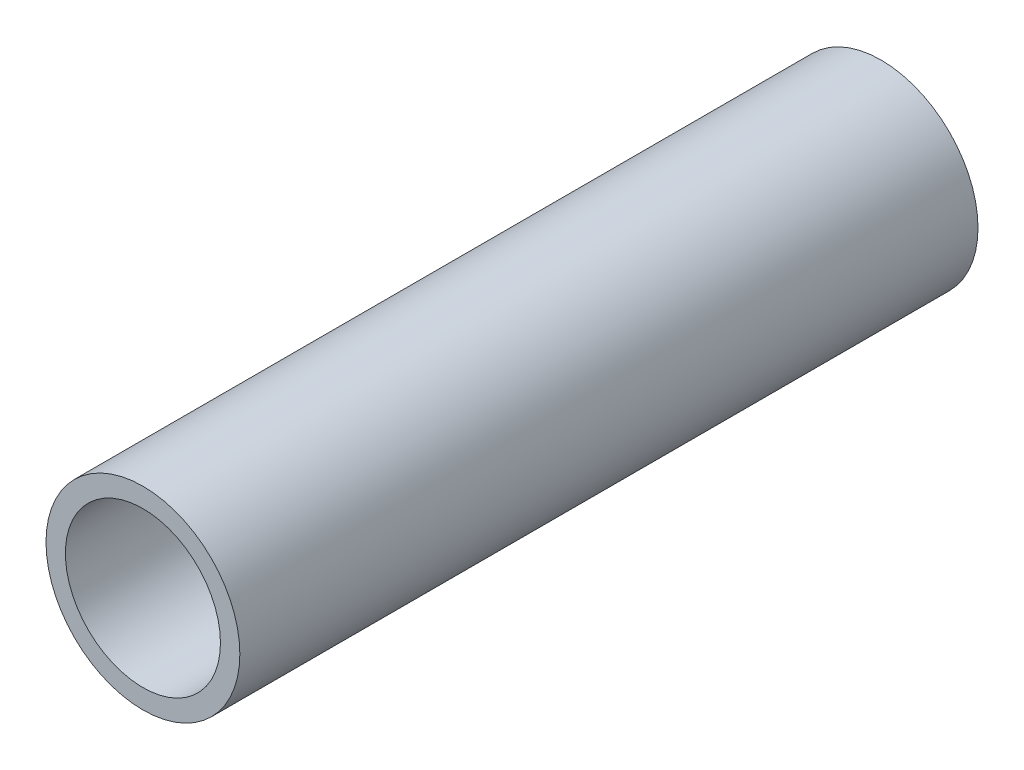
ISO-10303-21;
HEADER;
FILE_DESCRIPTION(('STEP AP214'),'2;1');
FILE_NAME('part.step','',(''),(''),'','','');
FILE_SCHEMA(('AUTOMOTIVE_DESIGN { 1 0 10303 214 1 1 1 1 }'));
ENDSEC;
DATA;
#1=APPLICATION_CONTEXT('core data for automotive mechanical design processes');
#2=APPLICATION_PROTOCOL_DEFINITION('international standard','automotive_design',2000,#1);
#3=PRODUCT_CONTEXT('',#1,'mechanical');
#4=PRODUCT('Part','Part','',(#3));
#5=PRODUCT_RELATED_PRODUCT_CATEGORY('part','',(#4));
#6=PRODUCT_DEFINITION_FORMATION('','',#4);
#7=PRODUCT_DEFINITION_CONTEXT('part definition',#1,'design');
#8=PRODUCT_DEFINITION('design','',#6,#7);
#9=PRODUCT_DEFINITION_SHAPE('','',#8);
#10=(LENGTH_UNIT() NAMED_UNIT(*) SI_UNIT(.MILLI.,.METRE.));
#11=(NAMED_UNIT(*) PLANE_ANGLE_UNIT() SI_UNIT($,.RADIAN.));
#12=(NAMED_UNIT(*) SI_UNIT($,.STERADIAN.) SOLID_ANGLE_UNIT());
#13=UNCERTAINTY_MEASURE_WITH_UNIT(LENGTH_MEASURE(1.E-05),#10,'distance_accuracy_value','');
#14=(GEOMETRIC_REPRESENTATION_CONTEXT(3) GLOBAL_UNCERTAINTY_ASSIGNED_CONTEXT((#13)) GLOBAL_UNIT_ASSIGNED_CONTEXT((#10,
#11,#12)) REPRESENTATION_CONTEXT('',''));
#15=CARTESIAN_POINT('',(0.,0.,0.));
#16=DIRECTION('',(0.,0.,1.));
#17=DIRECTION('',(1.,0.,0.));
#18=AXIS2_PLACEMENT_3D('',#15,#16,#17);
#19=CARTESIAN_POINT('',(0.,0.,60.452));
#20=DIRECTION('',(0.,0.,1.));
#21=DIRECTION('',(1.,0.,0.));
#22=AXIS2_PLACEMENT_3D('',#19,#20,#21);
#23=PLANE('',#22);
#24=CARTESIAN_POINT('',(0.,0.,60.452));
#25=DIRECTION('',(0.,0.,1.));
#26=DIRECTION('',(1.,0.,0.));
#27=AXIS2_PLACEMENT_3D('',#24,#25,#26);
#28=CIRCLE('',#27,15.875);
#29=CARTESIAN_POINT('',(15.875,0.,60.452));
#30=VERTEX_POINT('',#29);
#31=EDGE_CURVE('E10',#30,#30,#28,.T.);
#32=ORIENTED_EDGE('',*,*,#31,.T.);
#33=EDGE_LOOP('',(#32));
#34=FACE_BOUND('',#33,.T.);
#35=CARTESIAN_POINT('',(0.,0.,60.452));
#36=DIRECTION('',(0.,0.,1.));
#37=DIRECTION('',(1.,0.,0.));
#38=AXIS2_PLACEMENT_3D('',#35,#36,#37);
#39=CIRCLE('',#38,12.7);
#40=CARTESIAN_POINT('',(12.7,0.,60.452));
#41=VERTEX_POINT('',#40);
#42=EDGE_CURVE('E44',#41,#41,#39,.T.);
#43=ORIENTED_EDGE('',*,*,#42,.F.);
#44=EDGE_LOOP('',(#43));
#45=FACE_BOUND('',#44,.T.);
#46=ADVANCED_FACE('F33',(#34,#45),#23,.T.);
#47=CARTESIAN_POINT('',(0.,0.,-60.452));
#48=DIRECTION('',(0.,0.,1.));
#49=DIRECTION('',(1.,0.,0.));
#50=AXIS2_PLACEMENT_3D('',#47,#48,#49);
#51=PLANE('',#50);
#52=CARTESIAN_POINT('',(0.,0.,-60.452));
#53=DIRECTION('',(0.,0.,1.));
#54=DIRECTION('',(1.,0.,0.));
#55=AXIS2_PLACEMENT_3D('',#52,#53,#54);
#56=CIRCLE('',#55,15.875);
#57=CARTESIAN_POINT('',(15.875,0.,-60.452));
#58=VERTEX_POINT('',#57);
#59=EDGE_CURVE('E37',#58,#58,#56,.T.);
#60=ORIENTED_EDGE('',*,*,#59,.F.);
#61=EDGE_LOOP('',(#60));
#62=FACE_BOUND('',#61,.T.);
#63=CARTESIAN_POINT('',(0.,0.,-60.452));
#64=DIRECTION('',(0.,0.,1.));
#65=DIRECTION('',(1.,0.,0.));
#66=AXIS2_PLACEMENT_3D('',#63,#64,#65);
#67=CIRCLE('',#66,12.7);
#68=CARTESIAN_POINT('',(12.7,0.,-60.452));
#69=VERTEX_POINT('',#68);
#70=EDGE_CURVE('E46',#69,#69,#67,.T.);
#71=ORIENTED_EDGE('',*,*,#70,.T.);
#72=EDGE_LOOP('',(#71));
#73=FACE_BOUND('',#72,.T.);
#74=ADVANCED_FACE('F56',(#62,#73),#51,.F.);
#75=CARTESIAN_POINT('',(0.,0.,60.452));
#76=DIRECTION('',(0.,0.,-1.));
#77=DIRECTION('',(-1.,0.,0.));
#78=AXIS2_PLACEMENT_3D('',#75,#76,#77);
#79=CYLINDRICAL_SURFACE('',#78,15.875);
#80=ORIENTED_EDGE('',*,*,#31,.F.);
#81=EDGE_LOOP('',(#80));
#82=FACE_BOUND('',#81,.T.);
#83=ORIENTED_EDGE('',*,*,#59,.T.);
#84=EDGE_LOOP('',(#83));
#85=FACE_BOUND('',#84,.T.);
#86=ADVANCED_FACE('F35',(#82,#85),#79,.T.);
#87=CARTESIAN_POINT('',(0.,0.,60.452));
#88=DIRECTION('',(0.,0.,-1.));
#89=DIRECTION('',(-1.,0.,0.));
#90=AXIS2_PLACEMENT_3D('',#87,#88,#89);
#91=CYLINDRICAL_SURFACE('',#90,12.7);
#92=ORIENTED_EDGE('',*,*,#42,.T.);
#93=EDGE_LOOP('',(#92));
#94=FACE_BOUND('',#93,.T.);
#95=ORIENTED_EDGE('',*,*,#70,.F.);
#96=EDGE_LOOP('',(#95));
#97=FACE_BOUND('',#96,.T.);
#98=ADVANCED_FACE('F52',(#94,#97),#91,.F.);
#99=CLOSED_SHELL('',(#46,#74,#86,#98));
#100=MANIFOLD_SOLID_BREP('B2',#99);
#101=ADVANCED_BREP_SHAPE_REPRESENTATION('',(#18,#100),#14);
#102=SHAPE_DEFINITION_REPRESENTATION(#9,#101);
ENDSEC;
END-ISO-10303-21;
